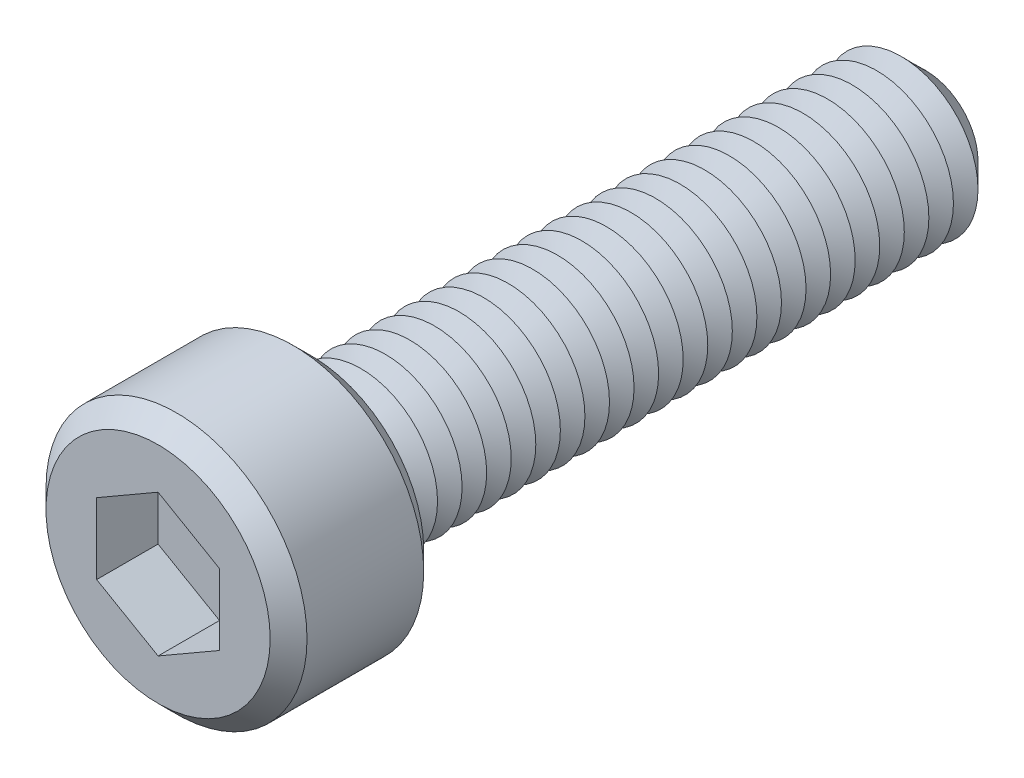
from build123d import *

# Parameters (mm, degrees)
SKETCH1_R           = 4.25
BOSS_EXTRUDE1_DEPTH = 5
SKETCH2_R           = 2.5
BOSS_EXTRUDE2_DEPTH = 20
CHAMFER1_SIZE       = 0.8
LPATTERN1_COUNT     = 24
LPATTERN1_PITCH     = 0.8
CUT_EXTRUDE1_DEPTH  = 2
SKETCH6_R           = 0.65
CUT_EXTRUDE2_DEPTH  = 23
CHAMFER2_SIZE       = 0.6


with BuildPart() as part:
    # Sketch1 → Boss-Extrude1 (new body)
    with BuildSketch(Plane.XY):
        Circle(SKETCH1_R)
    extrude(amount=BOSS_EXTRUDE1_DEPTH)

    # Sketch2 → Boss-Extrude2 (add)
    with BuildSketch(Plane(origin=(0, 0, 0), x_dir=(-1, 0, 0), z_dir=(0, 0, -1))):
        Circle(SKETCH2_R)
    extrude(amount=BOSS_EXTRUDE2_DEPTH)

    # Chamfer1
    chamfer1_edges = [part.edges().sort_by_distance(p)[0] for p in [
        (2.5, 0, -20),
    ]]
    chamfer(chamfer1_edges, length=CHAMFER1_SIZE)

    # Sketch4 → Cut-Revolve1 (revolve, cut)
    with BuildSketch(Plane(origin=(0, 0, 0), x_dir=(0, 0, -1), z_dir=(1, 0, 0)), mode=Mode.PRIVATE) as cut_revolve1_sk:
        Polygon((0, 2.5), (0.4, 1.807179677), (0.8, 2.5), align=None)
    cut_revolve1 = revolve(cut_revolve1_sk.sketch.rotate(Axis((0, 0, 2.512122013), (0, 0, -1)), 90), axis=Axis((0, 0, 2.512122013), (0, 0, -1)), mode=Mode.SUBTRACT)

    # LPattern1: Cut-Revolve1 ×24
    with Locations(*[(0, 0, -i * LPATTERN1_PITCH) for i in range(1, LPATTERN1_COUNT)]):
        add(cut_revolve1, mode=Mode.SUBTRACT)

    # Sketch5 → Cut-Extrude1 (cut)
    with BuildSketch(Plane.XY.offset(5)):
        Polygon((0, 2.309401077), (-2, 1.154700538), (-2, -1.154700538), (0, -2.309401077), (2, -1.154700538), (2, 1.154700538), align=None)
    extrude(amount=-CUT_EXTRUDE1_DEPTH, mode=Mode.SUBTRACT)

    # Sketch6 → Cut-Extrude2 (cut)
    with BuildSketch(Plane.XY.offset(3)):
        Circle(SKETCH6_R)
    extrude(amount=-CUT_EXTRUDE2_DEPTH, mode=Mode.SUBTRACT)

    # Chamfer2
    chamfer2_edges = [part.edges().sort_by_distance(p)[0] for p in [
        (-4.25, 0, 0),
        (-4.25, 0, 5),
    ]]
    chamfer(chamfer2_edges, length=CHAMFER2_SIZE)


solid = part.part
